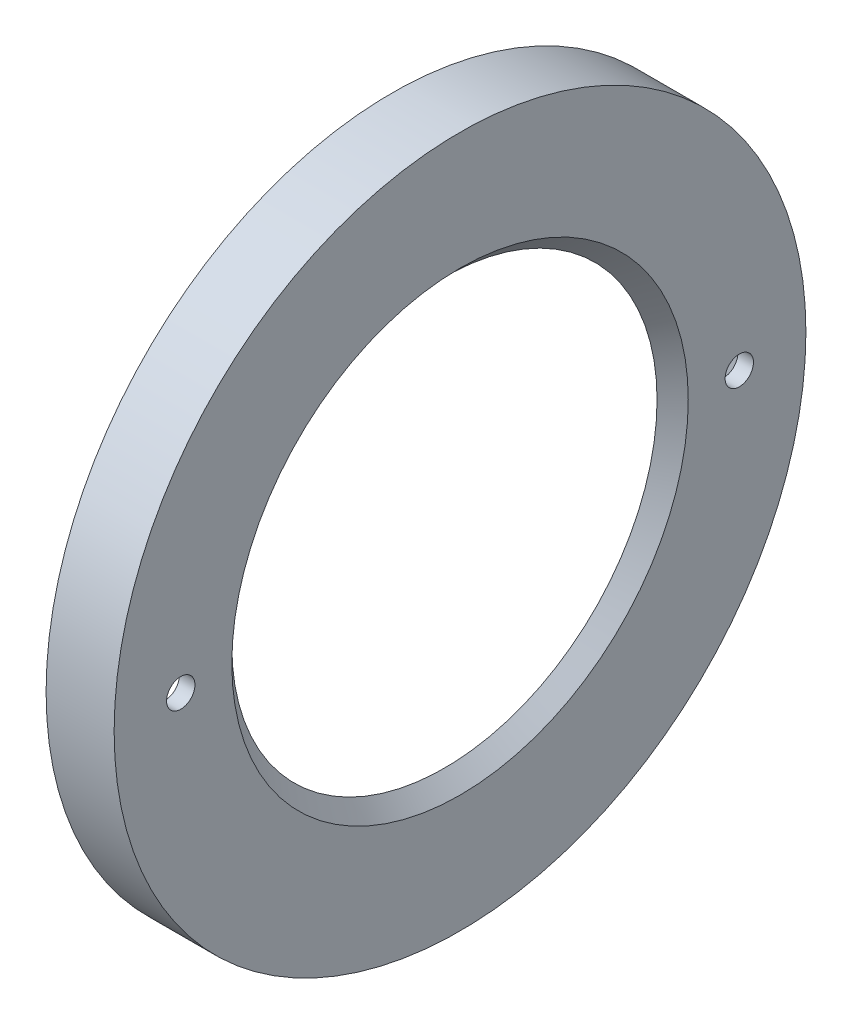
ISO-10303-21;
HEADER;
FILE_DESCRIPTION(('STEP AP214'),'2;1');
FILE_NAME('part.step','',(''),(''),'','','');
FILE_SCHEMA(('AUTOMOTIVE_DESIGN { 1 0 10303 214 1 1 1 1 }'));
ENDSEC;
DATA;
#1=APPLICATION_CONTEXT('core data for automotive mechanical design processes');
#2=APPLICATION_PROTOCOL_DEFINITION('international standard','automotive_design',2000,#1);
#3=PRODUCT_CONTEXT('',#1,'mechanical');
#4=PRODUCT('Part','Part','',(#3));
#5=PRODUCT_RELATED_PRODUCT_CATEGORY('part','',(#4));
#6=PRODUCT_DEFINITION_FORMATION('','',#4);
#7=PRODUCT_DEFINITION_CONTEXT('part definition',#1,'design');
#8=PRODUCT_DEFINITION('design','',#6,#7);
#9=PRODUCT_DEFINITION_SHAPE('','',#8);
#10=(LENGTH_UNIT() NAMED_UNIT(*) SI_UNIT(.MILLI.,.METRE.));
#11=(NAMED_UNIT(*) PLANE_ANGLE_UNIT() SI_UNIT($,.RADIAN.));
#12=(NAMED_UNIT(*) SI_UNIT($,.STERADIAN.) SOLID_ANGLE_UNIT());
#13=UNCERTAINTY_MEASURE_WITH_UNIT(LENGTH_MEASURE(1.E-05),#10,'distance_accuracy_value','');
#14=(GEOMETRIC_REPRESENTATION_CONTEXT(3) GLOBAL_UNCERTAINTY_ASSIGNED_CONTEXT((#13)) GLOBAL_UNIT_ASSIGNED_CONTEXT((#10,
#11,#12)) REPRESENTATION_CONTEXT('',''));
#15=CARTESIAN_POINT('',(0.,0.,0.));
#16=DIRECTION('',(0.,0.,1.));
#17=DIRECTION('',(1.,0.,0.));
#18=AXIS2_PLACEMENT_3D('',#15,#16,#17);
#19=CARTESIAN_POINT('',(-1.02312617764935,0.,0.));
#20=DIRECTION('',(-1.,0.,0.));
#21=DIRECTION('',(0.,0.,1.));
#22=AXIS2_PLACEMENT_3D('',#19,#20,#21);
#23=CYLINDRICAL_SURFACE('',#22,12.2);
#24=CARTESIAN_POINT('',(0.,0.,0.));
#25=DIRECTION('',(-1.,0.,0.));
#26=DIRECTION('',(0.,0.,1.));
#27=AXIS2_PLACEMENT_3D('',#24,#25,#26);
#28=CIRCLE('',#27,12.2);
#29=CARTESIAN_POINT('',(0.,0.,12.2));
#30=VERTEX_POINT('',#29);
#31=EDGE_CURVE('E67',#30,#30,#28,.T.);
#32=ORIENTED_EDGE('',*,*,#31,.F.);
#33=EDGE_LOOP('',(#32));
#34=FACE_BOUND('',#33,.T.);
#35=CARTESIAN_POINT('',(2.4,0.,0.));
#36=DIRECTION('',(-1.,0.,0.));
#37=DIRECTION('',(0.,0.,1.));
#38=AXIS2_PLACEMENT_3D('',#35,#36,#37);
#39=CIRCLE('',#38,12.2);
#40=CARTESIAN_POINT('',(2.4,0.,12.2));
#41=VERTEX_POINT('',#40);
#42=EDGE_CURVE('E47',#41,#41,#39,.T.);
#43=ORIENTED_EDGE('',*,*,#42,.T.);
#44=EDGE_LOOP('',(#43));
#45=FACE_BOUND('',#44,.T.);
#46=ADVANCED_FACE('F38',(#34,#45),#23,.T.);
#47=CARTESIAN_POINT('',(2.4,12.2,0.));
#48=DIRECTION('',(-1.,0.,0.));
#49=DIRECTION('',(0.,0.,1.));
#50=AXIS2_PLACEMENT_3D('',#47,#48,#49);
#51=PLANE('',#50);
#52=CARTESIAN_POINT('',(2.4,0.,0.));
#53=DIRECTION('',(-1.,0.,0.));
#54=DIRECTION('',(0.,0.,1.));
#55=AXIS2_PLACEMENT_3D('',#52,#53,#54);
#56=CIRCLE('',#55,8.05);
#57=CARTESIAN_POINT('',(2.4,0.,8.05));
#58=VERTEX_POINT('',#57);
#59=EDGE_CURVE('E10',#58,#58,#56,.T.);
#60=ORIENTED_EDGE('',*,*,#59,.T.);
#61=EDGE_LOOP('',(#60));
#62=FACE_BOUND('',#61,.T.);
#63=CARTESIAN_POINT('',(2.4,0.,9.85));
#64=DIRECTION('',(1.,0.,0.));
#65=DIRECTION('',(0.,0.,-1.));
#66=AXIS2_PLACEMENT_3D('',#63,#64,#65);
#67=CIRCLE('',#66,0.500000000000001);
#68=CARTESIAN_POINT('',(2.4,0.,9.35));
#69=VERTEX_POINT('',#68);
#70=EDGE_CURVE('E76',#69,#69,#67,.T.);
#71=ORIENTED_EDGE('',*,*,#70,.F.);
#72=EDGE_LOOP('',(#71));
#73=FACE_BOUND('',#72,.T.);
#74=CARTESIAN_POINT('',(2.4,0.,-9.85));
#75=DIRECTION('',(1.,0.,0.));
#76=DIRECTION('',(0.,0.,-1.));
#77=AXIS2_PLACEMENT_3D('',#74,#75,#76);
#78=CIRCLE('',#77,0.500000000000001);
#79=CARTESIAN_POINT('',(2.4,0.,-10.35));
#80=VERTEX_POINT('',#79);
#81=EDGE_CURVE('E77',#80,#80,#78,.T.);
#82=ORIENTED_EDGE('',*,*,#81,.F.);
#83=EDGE_LOOP('',(#82));
#84=FACE_BOUND('',#83,.T.);
#85=ORIENTED_EDGE('',*,*,#42,.F.);
#86=EDGE_LOOP('',(#85));
#87=FACE_BOUND('',#86,.T.);
#88=ADVANCED_FACE('F91',(#62,#73,#84,#87),#51,.F.);
#89=CARTESIAN_POINT('',(1.85,10.6,0.));
#90=DIRECTION('',(1.,0.,0.));
#91=DIRECTION('',(0.,0.,-1.));
#92=AXIS2_PLACEMENT_3D('',#89,#90,#91);
#93=PLANE('',#92);
#94=CARTESIAN_POINT('',(1.85,0.,9.85));
#95=DIRECTION('',(1.,0.,0.));
#96=DIRECTION('',(0.,0.,-1.));
#97=AXIS2_PLACEMENT_3D('',#94,#95,#96);
#98=CIRCLE('',#97,0.500000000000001);
#99=CARTESIAN_POINT('',(1.85,0.,9.35));
#100=VERTEX_POINT('',#99);
#101=EDGE_CURVE('E71',#100,#100,#98,.F.);
#102=ORIENTED_EDGE('',*,*,#101,.F.);
#103=EDGE_LOOP('',(#102));
#104=FACE_BOUND('',#103,.T.);
#105=CARTESIAN_POINT('',(1.85,0.,-9.85));
#106=DIRECTION('',(1.,0.,0.));
#107=DIRECTION('',(0.,0.,-1.));
#108=AXIS2_PLACEMENT_3D('',#105,#106,#107);
#109=CIRCLE('',#108,0.500000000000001);
#110=CARTESIAN_POINT('',(1.85,0.,-10.35));
#111=VERTEX_POINT('',#110);
#112=EDGE_CURVE('E72',#111,#111,#109,.F.);
#113=ORIENTED_EDGE('',*,*,#112,.F.);
#114=EDGE_LOOP('',(#113));
#115=FACE_BOUND('',#114,.T.);
#116=CARTESIAN_POINT('',(1.85,0.,0.));
#117=DIRECTION('',(-1.,0.,0.));
#118=DIRECTION('',(0.,0.,1.));
#119=AXIS2_PLACEMENT_3D('',#116,#117,#118);
#120=CIRCLE('',#119,7.5);
#121=CARTESIAN_POINT('',(1.85,0.,7.5));
#122=VERTEX_POINT('',#121);
#123=EDGE_CURVE('E52',#122,#122,#120,.T.);
#124=ORIENTED_EDGE('',*,*,#123,.F.);
#125=EDGE_LOOP('',(#124));
#126=FACE_BOUND('',#125,.T.);
#127=CARTESIAN_POINT('',(1.85,0.,0.));
#128=DIRECTION('',(-1.,0.,0.));
#129=DIRECTION('',(0.,0.,1.));
#130=AXIS2_PLACEMENT_3D('',#127,#128,#129);
#131=CIRCLE('',#130,10.6);
#132=CARTESIAN_POINT('',(1.85,0.,10.6));
#133=VERTEX_POINT('',#132);
#134=EDGE_CURVE('E57',#133,#133,#131,.T.);
#135=ORIENTED_EDGE('',*,*,#134,.T.);
#136=EDGE_LOOP('',(#135));
#137=FACE_BOUND('',#136,.T.);
#138=ADVANCED_FACE('F94',(#104,#115,#126,#137),#93,.F.);
#139=CARTESIAN_POINT('',(-1.02312617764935,0.,0.));
#140=DIRECTION('',(-1.,0.,0.));
#141=DIRECTION('',(0.,0.,1.));
#142=AXIS2_PLACEMENT_3D('',#139,#140,#141);
#143=CYLINDRICAL_SURFACE('',#142,10.6);
#144=ORIENTED_EDGE('',*,*,#134,.F.);
#145=EDGE_LOOP('',(#144));
#146=FACE_BOUND('',#145,.T.);
#147=CARTESIAN_POINT('',(0.,0.,0.));
#148=DIRECTION('',(-1.,0.,0.));
#149=DIRECTION('',(0.,0.,1.));
#150=AXIS2_PLACEMENT_3D('',#147,#148,#149);
#151=CIRCLE('',#150,10.6);
#152=CARTESIAN_POINT('',(0.,0.,10.6));
#153=VERTEX_POINT('',#152);
#154=EDGE_CURVE('E63',#153,#153,#151,.T.);
#155=ORIENTED_EDGE('',*,*,#154,.T.);
#156=EDGE_LOOP('',(#155));
#157=FACE_BOUND('',#156,.T.);
#158=ADVANCED_FACE('F108',(#146,#157),#143,.F.);
#159=CARTESIAN_POINT('',(0.,10.6,0.));
#160=DIRECTION('',(1.,0.,0.));
#161=DIRECTION('',(0.,0.,-1.));
#162=AXIS2_PLACEMENT_3D('',#159,#160,#161);
#163=PLANE('',#162);
#164=ORIENTED_EDGE('',*,*,#154,.F.);
#165=EDGE_LOOP('',(#164));
#166=FACE_BOUND('',#165,.T.);
#167=ORIENTED_EDGE('',*,*,#31,.T.);
#168=EDGE_LOOP('',(#167));
#169=FACE_BOUND('',#168,.T.);
#170=ADVANCED_FACE('F102',(#166,#169),#163,.F.);
#171=CARTESIAN_POINT('',(-0.00100000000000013,0.,-9.85));
#172=DIRECTION('',(1.,0.,0.));
#173=DIRECTION('',(0.,0.,-1.));
#174=AXIS2_PLACEMENT_3D('',#171,#172,#173);
#175=CYLINDRICAL_SURFACE('',#174,0.500000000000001);
#176=ORIENTED_EDGE('',*,*,#81,.T.);
#177=EDGE_LOOP('',(#176));
#178=FACE_BOUND('',#177,.T.);
#179=ORIENTED_EDGE('',*,*,#112,.T.);
#180=EDGE_LOOP('',(#179));
#181=FACE_BOUND('',#180,.T.);
#182=ADVANCED_FACE('F99',(#178,#181),#175,.F.);
#183=CARTESIAN_POINT('',(-0.00100000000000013,0.,9.85));
#184=DIRECTION('',(1.,0.,0.));
#185=DIRECTION('',(0.,0.,-1.));
#186=AXIS2_PLACEMENT_3D('',#183,#184,#185);
#187=CYLINDRICAL_SURFACE('',#186,0.500000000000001);
#188=ORIENTED_EDGE('',*,*,#70,.T.);
#189=EDGE_LOOP('',(#188));
#190=FACE_BOUND('',#189,.T.);
#191=ORIENTED_EDGE('',*,*,#101,.T.);
#192=EDGE_LOOP('',(#191));
#193=FACE_BOUND('',#192,.T.);
#194=ADVANCED_FACE('F88',(#190,#193),#187,.F.);
#195=CARTESIAN_POINT('',(2.4,0.,0.));
#196=DIRECTION('',(1.,0.,0.));
#197=DIRECTION('',(0.,0.,-1.));
#198=AXIS2_PLACEMENT_3D('',#195,#196,#197);
#199=CONICAL_SURFACE('',#198,8.05,0.785398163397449);
#200=ORIENTED_EDGE('',*,*,#123,.T.);
#201=EDGE_LOOP('',(#200));
#202=FACE_BOUND('',#201,.T.);
#203=ORIENTED_EDGE('',*,*,#59,.F.);
#204=EDGE_LOOP('',(#203));
#205=FACE_BOUND('',#204,.T.);
#206=ADVANCED_FACE('F41',(#202,#205),#199,.F.);
#207=CLOSED_SHELL('',(#46,#88,#138,#158,#170,#182,#194,#206));
#208=MANIFOLD_SOLID_BREP('B2',#207);
#209=ADVANCED_BREP_SHAPE_REPRESENTATION('',(#18,#208),#14);
#210=SHAPE_DEFINITION_REPRESENTATION(#9,#209);
ENDSEC;
END-ISO-10303-21;
